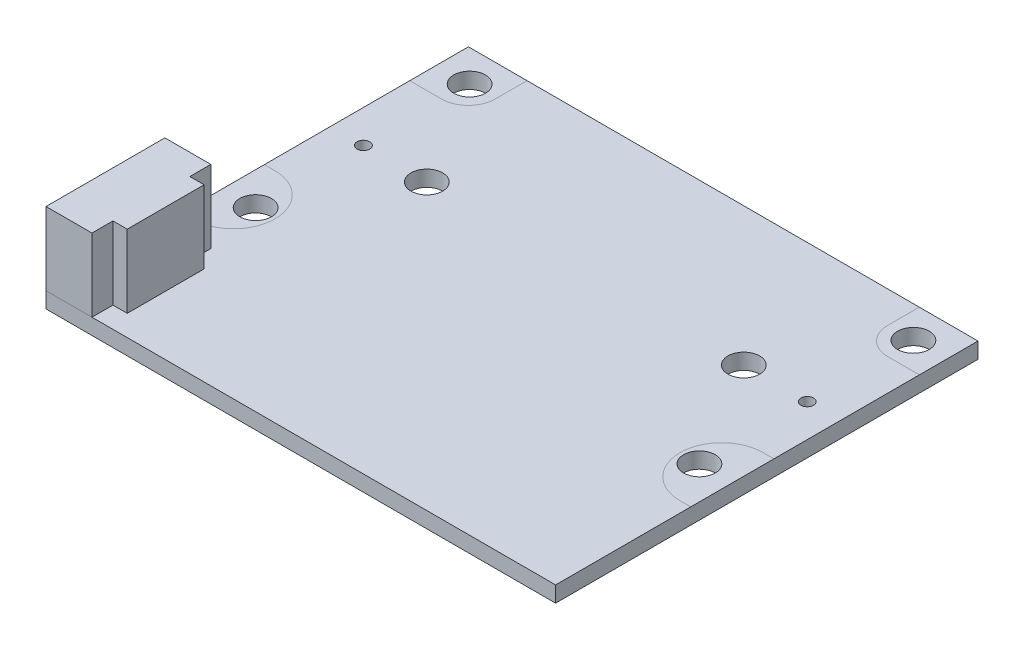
from build123d import *

# Parameters (mm, degrees)
SKETCH1_W           = 32.15
SKETCH1_H           = 26.65
SKETCH1_R           = 1
SKETCH1_R_2         = 0.4
BOSS_EXTRUDE1_DEPTH = 1
BOSS_EXTRUDE3_DEPTH = 4.6


with BuildPart() as part:
    # Sketch1 → Boss-Extrude1 (new body)
    with BuildSketch(Plane(origin=(0, 0, 0), x_dir=(1, 0, 0), z_dir=(0, 1, 0))):
        with Locations((0, -4.625)):
            Rectangle(SKETCH1_W, SKETCH1_H)
        with Locations(Location((14, 6.7, 0), (0, 0, 270))):
            Circle(SKETCH1_R, mode=Mode.SUBTRACT)
        with Locations(Location((14, -6.8, 0), (0, 0, 270))):
            Circle(SKETCH1_R, mode=Mode.SUBTRACT)
        with Locations(Location((14, 0, 0), (0, 0, 270))):
            Circle(SKETCH1_R_2, mode=Mode.SUBTRACT)
        with Locations(Location((10, 0, 0), (0, 0, 270))):
            Circle(SKETCH1_R, mode=Mode.SUBTRACT)
        with Locations(Location((-14, 0, 0), (0, 0, 90))):
            Circle(SKETCH1_R_2, mode=Mode.SUBTRACT)
        with Locations(Location((-14, -6.8, 0), (0, 0, 90))):
            Circle(SKETCH1_R, mode=Mode.SUBTRACT)
        with Locations(Location((-14, 6.7, 0), (0, 0, 90))):
            Circle(SKETCH1_R, mode=Mode.SUBTRACT)
        with Locations(Location((-10, 0, 0), (0, 0, 90))):
            Circle(SKETCH1_R, mode=Mode.SUBTRACT)
    extrude(amount=BOSS_EXTRUDE1_DEPTH)


with BuildPart() as body_2:
    # Sketch5 → Boss-Extrude3 (new body)
    with BuildSketch(Plane(origin=(0, 1, 0), x_dir=(1, 0, 0), z_dir=(0, 1, 0))):
        Polygon((-16.075, -17.95), (-13.175, -17.95), (-13.175, -16.625), (-12.275, -16.625), (-12.275, -11.775), (-13.175, -11.775), (-13.175, -10.45), (-16.075, -10.45), align=None)
    extrude(amount=BOSS_EXTRUDE3_DEPTH)


solid = Compound([part.part, body_2.part])
